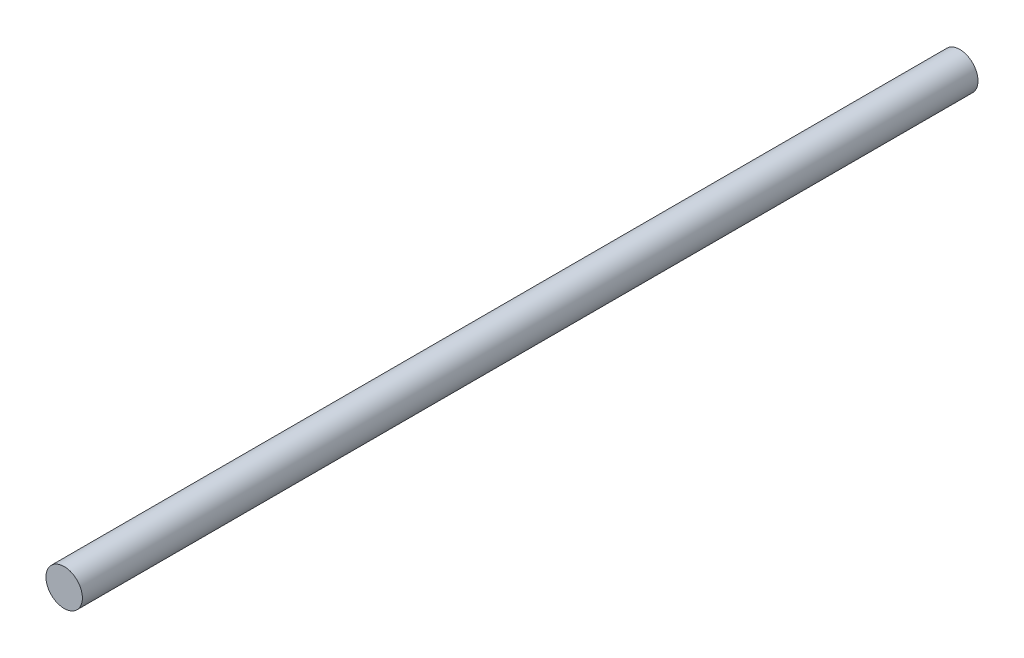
from build123d import *

# Parameters (mm, degrees)
ESQUISSE1_R      = 2.5
EXTRUSION1_DEPTH = 123


with BuildPart() as part:
    # Esquisse1 → Extrusion1 (new body)
    with BuildSketch(Plane.XY):
        Circle(ESQUISSE1_R)
    extrude(amount=EXTRUSION1_DEPTH)


solid = part.part
